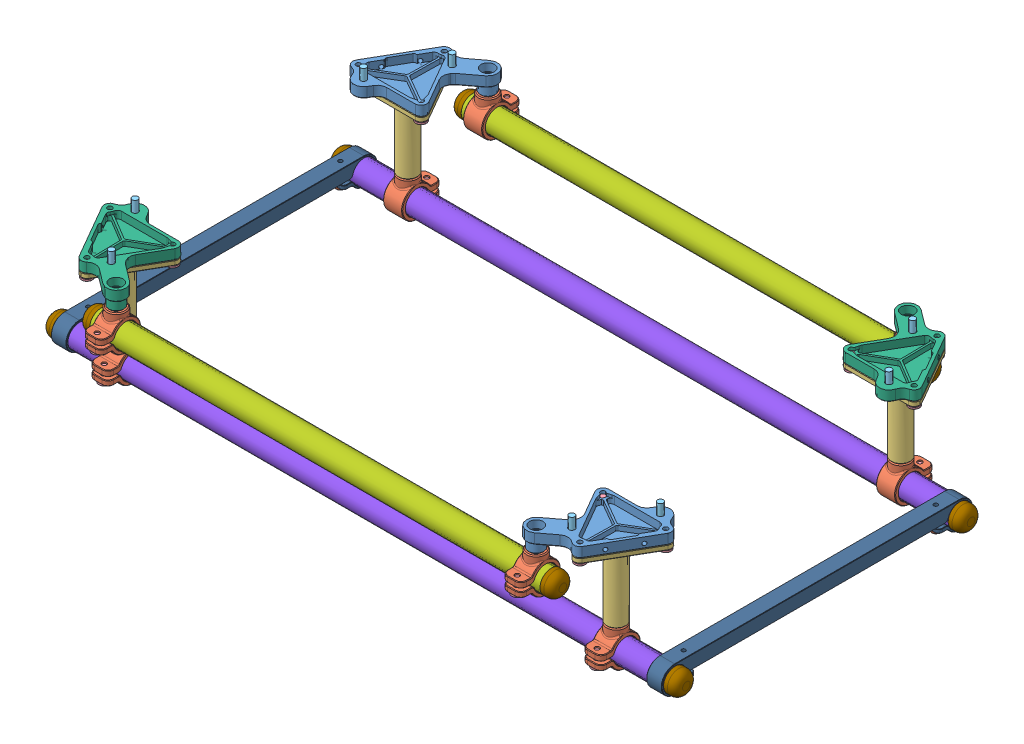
SolidWorks assembly M600 MODULE MOUNT.sldasm, configuration Default (file format 9000). Lengths in mm.
Overall size (335.36 70.79 251.66).
74 component instances, 11 part files, 0 mates.
Components (placement in the parent):
- M600 MODULE MOUNT_2-001-1: M600 MODULE MOUNT_2-001.sldasm [Default] at (168.1458 -5.6 97.079) x (0.5 0 -0.866025) z (0.866025 0 0.5) size (71.88 70.3 50.95)
  - M600 MODULE MOUNT_2-01-1: M600 MODULE MOUNT_2-01.sldprt [Default] x (1 0 0) z (0 -1 0) size (56.3 34.5 12.5)
  - M600 MODULE MOUNT_2-02-1: M600 MODULE MOUNT_2-02.sldprt [Default] at (0 -52.5 -45) x (0.866025 0 -0.5) z (0.5 0 0.866025) size (21 19 10.17)
  - M600 MODULE MOUNT_2-03-1: M600 MODULE MOUNT_2-03.sldprt [Default] at (0 -41.5 -45) x (-0.5 0 0.866025) z (-0.866025 0 -0.5) size (38.91 42 34.5)
  - M600 MODULE MOUNT_2-02-2: M600 MODULE MOUNT_2-02.sldprt [Default] at (-29.3 -17.5 -50.1962) x (0.866025 0 -0.5) z (0.5 0 0.866025) size (21 19 10.17)
  - D600 BASE_3-12-1: D600 BASE_3-12.sldprt [Default] at (-16.4545 -5 -35.5) x (0.999947 0 0.010342) z (0 1 0) size (5.5 5.5 7.5)
  - D600 BASE_3-12-2: D600 BASE_3-12.sldprt [Default] at (16.4545 -5 -35.5) x (0.999947 0 0.010342) z (0 1 0) size (5.5 5.5 7.5)
  - D600 BASE_3-12-3: D600 BASE_3-12.sldprt [Default] at (0 -5 -64) x (0.999947 0 0.010342) z (0 1 0) size (5.5 5.5 7.5)
  - D600 BASE_3-12-4: D600 BASE_3-12.sldprt [Default] at (-37.9603 -22 -45.1962) x (0.999947 0 0.010342) z (0 1 0) size (5.5 5.5 7.5)
  - D600 BASE_3-12-5: D600 BASE_3-12.sldprt [Default] at (-29.3 -11 -50.1962) x (0.999947 0 0.010342) z (0 1 0) size (5.5 5.5 7.5)
  - D600 BASE_3-12-6: D600 BASE_3-12.sldprt [Default] at (-8.6603 -57 -40) x (0.999947 0 0.010342) z (0 1 0) size (5.5 5.5 7.5)
  - D600 BASE_3-12-7: D600 BASE_3-12.sldprt [Default] at (0 -46 -45) x (0.999947 0 0.010342) z (0 1 0) size (5.5 5.5 7.5)
  - D600 BASE_6-08-1: D600 BASE_6-08.sldprt [Default] at (-17 1 -45) x (0.957409 0 0.288735) z (0 1 0) size (5.5 5.5 8.8)
  - D600 BASE_6-08-2: D600 BASE_6-08.sldprt [Default] at (17 1 -45) x (0.957409 0 0.288735) z (0 1 0) size (5.5 5.5 8.8)
- M600 MODULE MOUNT_2-001-2: M600 MODULE MOUNT_2-001.sldasm [Default] at (-168.1458 -5.6 -97.079) x (-0.5 0 0.866025) z (-0.866025 0 -0.5) size (71.88 70.3 50.95)
  - M600 MODULE MOUNT_2-01-1: M600 MODULE MOUNT_2-01.sldprt [Default] x (1 0 0) z (0 -1 0) size (56.3 34.5 12.5)
  - M600 MODULE MOUNT_2-02-1: M600 MODULE MOUNT_2-02.sldprt [Default] at (0 -52.5 -45) x (0.866025 0 -0.5) z (0.5 0 0.866025) size (21 19 10.17)
  - M600 MODULE MOUNT_2-03-1: M600 MODULE MOUNT_2-03.sldprt [Default] at (0 -41.5 -45) x (-0.5 0 0.866025) z (-0.866025 0 -0.5) size (38.91 42 34.5)
  - M600 MODULE MOUNT_2-02-2: M600 MODULE MOUNT_2-02.sldprt [Default] at (-29.3 -17.5 -50.1962) x (0.866025 0 -0.5) z (0.5 0 0.866025) size (21 19 10.17)
  - D600 BASE_3-12-1: D600 BASE_3-12.sldprt [Default] at (-16.4545 -5 -35.5) x (0.999947 0 0.010342) z (0 1 0) size (5.5 5.5 7.5)
  - D600 BASE_3-12-2: D600 BASE_3-12.sldprt [Default] at (16.4545 -5 -35.5) x (0.999947 0 0.010342) z (0 1 0) size (5.5 5.5 7.5)
  - D600 BASE_3-12-3: D600 BASE_3-12.sldprt [Default] at (0 -5 -64) x (0.999947 0 0.010342) z (0 1 0) size (5.5 5.5 7.5)
  - D600 BASE_3-12-4: D600 BASE_3-12.sldprt [Default] at (-37.9603 -22 -45.1962) x (0.999947 0 0.010342) z (0 1 0) size (5.5 5.5 7.5)
  - D600 BASE_3-12-5: D600 BASE_3-12.sldprt [Default] at (-29.3 -11 -50.1962) x (0.999947 0 0.010342) z (0 1 0) size (5.5 5.5 7.5)
  - D600 BASE_3-12-6: D600 BASE_3-12.sldprt [Default] at (-8.6603 -57 -40) x (0.999947 0 0.010342) z (0 1 0) size (5.5 5.5 7.5)
  - D600 BASE_3-12-7: D600 BASE_3-12.sldprt [Default] at (0 -46 -45) x (0.999947 0 0.010342) z (0 1 0) size (5.5 5.5 7.5)
  - D600 BASE_6-08-1: D600 BASE_6-08.sldprt [Default] at (-17 1 -45) x (0.957409 0 0.288735) z (0 1 0) size (5.5 5.5 8.8)
  - D600 BASE_6-08-2: D600 BASE_6-08.sldprt [Default] at (17 1 -45) x (0.957409 0 0.288735) z (0 1 0) size (5.5 5.5 8.8)
- M600 MODULE MOUNT_2-002-1: M600 MODULE MOUNT_2-002.sldasm [Default] at (-129.1747 -5.6 74.579) x (-0.5 0 -0.866025) z (0.866025 0 -0.5) size (65.1 70.3 36.26)
  - M600 MODULE MOUNT_2-03-1: M600 MODULE MOUNT_2-03.sldprt [Default] at (0 -41.5 0) x (-1 0 0) z (0 0 -1) size (38.91 42 34.5)
  - M600 MODULE MOUNT_2-02-1: M600 MODULE MOUNT_2-02.sldprt [Default] at (0 -52.5 0) x (0.866025 0 0.5) z (-0.5 0 0.866025) size (21 19 10.17)
  - M600 MODULE MOUNT_2-04-1: M600 MODULE MOUNT_2-04.sldprt [Default] x (1 0 0) z (0 -1 0) size (56.3 34.5 12.5)
  - M600 MODULE MOUNT_2-02-2: M600 MODULE MOUNT_2-02.sldprt [Default] at (-29.3 -17.5 5.1962) x (0.866025 0 0.5) z (-0.5 0 0.866025) size (21 19 10.17)
  - D600 BASE_3-12-1: D600 BASE_3-12.sldprt [Default] at (0 -5 19) x (0.752686 0 0.65838) z (0 1 0) size (5.5 5.5 7.5)
  - D600 BASE_3-12-2: D600 BASE_3-12.sldprt [Default] at (-16.4545 -5 -9.5) x (0.752686 0 0.65838) z (0 1 0) size (5.5 5.5 7.5)
  - D600 BASE_3-12-3: D600 BASE_3-12.sldprt [Default] at (16.4545 -5 -9.5) x (0.752686 0 0.65838) z (0 1 0) size (5.5 5.5 7.5)
  - D600 BASE_3-12-4: D600 BASE_3-12.sldprt [Default] at (-29.3 -11 5.1962) x (0.999882 0 0.015357) z (0 1 0) size (5.5 5.5 7.5)
  - D600 BASE_3-12-5: D600 BASE_3-12.sldprt [Default] at (-37.9603 -22 0.1962) x (-0.837957 0 -0.545736) z (0 1 0) size (5.5 5.5 7.5)
  - D600 BASE_3-12-6: D600 BASE_3-12.sldprt [Default] at (-8.6603 -57 -5) x (0.752686 0 0.65838) z (0 1 0) size (5.5 5.5 7.5)
  - D600 BASE_3-12-7: D600 BASE_3-12.sldprt [Default] at (0 -46 0) x (0.752686 0 0.65838) z (0 1 0) size (5.5 5.5 7.5)
  - D600 BASE_6-08-1: D600 BASE_6-08.sldprt [Default] at (17 1 0) x (0.889089 0 -0.457734) z (0 1 0) size (5.5 5.5 8.8)
  - D600 BASE_6-08-2: D600 BASE_6-08.sldprt [Default] at (-17 1 0) x (0.503799 0 -0.863821) z (0 1 0) size (5.5 5.5 8.8)
- M600 MODULE MOUNT_2-002-2: M600 MODULE MOUNT_2-002.sldasm [Default] at (129.1747 -5.6 -74.579) x (0.5 0 0.866025) z (-0.866025 0 0.5) size (65.1 70.3 36.26)
  - M600 MODULE MOUNT_2-03-1: M600 MODULE MOUNT_2-03.sldprt [Default] at (0 -41.5 0) x (-1 0 0) z (0 0 -1) size (38.91 42 34.5)
  - M600 MODULE MOUNT_2-02-1: M600 MODULE MOUNT_2-02.sldprt [Default] at (0 -52.5 0) x (0.866025 0 0.5) z (-0.5 0 0.866025) size (21 19 10.17)
  - M600 MODULE MOUNT_2-04-1: M600 MODULE MOUNT_2-04.sldprt [Default] x (1 0 0) z (0 -1 0) size (56.3 34.5 12.5)
  - M600 MODULE MOUNT_2-02-2: M600 MODULE MOUNT_2-02.sldprt [Default] at (-29.3 -17.5 5.1962) x (0.866025 0 0.5) z (-0.5 0 0.866025) size (21 19 10.17)
  - D600 BASE_3-12-1: D600 BASE_3-12.sldprt [Default] at (0 -5 19) x (0.752686 0 0.65838) z (0 1 0) size (5.5 5.5 7.5)
  - D600 BASE_3-12-2: D600 BASE_3-12.sldprt [Default] at (-16.4545 -5 -9.5) x (0.752686 0 0.65838) z (0 1 0) size (5.5 5.5 7.5)
  - D600 BASE_3-12-3: D600 BASE_3-12.sldprt [Default] at (16.4545 -5 -9.5) x (0.752686 0 0.65838) z (0 1 0) size (5.5 5.5 7.5)
  - D600 BASE_3-12-4: D600 BASE_3-12.sldprt [Default] at (-29.3 -11 5.1962) x (0.999882 0 0.015357) z (0 1 0) size (5.5 5.5 7.5)
  - D600 BASE_3-12-5: D600 BASE_3-12.sldprt [Default] at (-37.9603 -22 0.1962) x (-0.837957 0 -0.545736) z (0 1 0) size (5.5 5.5 7.5)
  - D600 BASE_3-12-6: D600 BASE_3-12.sldprt [Default] at (-8.6603 -57 -5) x (0.752686 0 0.65838) z (0 1 0) size (5.5 5.5 7.5)
  - D600 BASE_3-12-7: D600 BASE_3-12.sldprt [Default] at (0 -46 0) x (0.752686 0 0.65838) z (0 1 0) size (5.5 5.5 7.5)
  - D600 BASE_6-08-1: D600 BASE_6-08.sldprt [Default] at (17 1 0) x (0.889089 0 -0.457734) z (0 1 0) size (5.5 5.5 8.8)
  - D600 BASE_6-08-2: D600 BASE_6-08.sldprt [Default] at (-17 1 0) x (0.503799 0 -0.863821) z (0 1 0) size (5.5 5.5 8.8)
- M600 MODULE MOUNT_2-05-1: M600 MODULE MOUNT_2-05.sldprt [Default] at (-118 -23.1 -97.3555) x (0 -0.259561 -0.965727) z (1 0 0) size (12 12 236)
- M600 MODULE MOUNT_2-06-1: M600 MODULE MOUNT_2-06.sldprt [Default] at (-160 -58.1 -74.579) x (0 0.155529 -0.987831) z (1 0 0) size (12 12 320)
- M600 MODULE MOUNT_2-05-2: M600 MODULE MOUNT_2-05.sldprt [Default] at (-118 -23.1 97.3555) x (0 -0.259561 -0.965727) z (1 0 0) size (12 12 236)
- M600 MODULE MOUNT_2-06-2: M600 MODULE MOUNT_2-06.sldprt [Default] at (-160 -58.1 74.579) x (0 0.037814 -0.999285) z (1 0 0) size (12 12 320)
- M600 MODULE MOUNT_2-07-1: M600 MODULE MOUNT_2-07.sldprt [Default] at (-160 -104.9551 -12.6681) x (0 0.601138 -0.799145) z (0 -0.799145 -0.601138) size (12 15.07 12)
- M600 MODULE MOUNT_2-07-2: M600 MODULE MOUNT_2-07.sldprt [Default] at (-160 -104.9551 136.4899) x (0 0.601138 -0.799145) z (0 -0.799145 -0.601138) size (12 15.07 12)
- M600 MODULE MOUNT_2-07-3: M600 MODULE MOUNT_2-07.sldprt [Default] at (-118 -69.9551 159.2664) x (0 0.601138 -0.799145) z (0 -0.799145 -0.601138) size (12 15.07 12)
- M600 MODULE MOUNT_2-07-4: M600 MODULE MOUNT_2-07.sldprt [Default] at (-118 -69.9551 -35.4446) x (0 0.601138 -0.799145) z (0 -0.799145 -0.601138) size (12 15.07 12)
- M600 MODULE MOUNT_2-07-5: M600 MODULE MOUNT_2-07.sldprt [Default] at (118 -77.6229 42.0779) x (0 0.700145 0.714001) z (0 -0.714001 0.700145) size (12 15.07 12)
- M600 MODULE MOUNT_2-07-6: M600 MODULE MOUNT_2-07.sldprt [Default] at (160 -112.6229 19.3014) x (0 0.700145 0.714001) z (0 -0.714001 0.700145) size (12 15.07 12)
- M600 MODULE MOUNT_2-07-7: M600 MODULE MOUNT_2-07.sldprt [Default] at (160 -114.8323 -127.5866) x (0 0.728687 0.684847) z (0 -0.684847 0.728687) size (12 15.07 12)
- M600 MODULE MOUNT_2-07-8: M600 MODULE MOUNT_2-07.sldprt [Default] at (118 -79.8323 -150.3631) x (0 0.728687 0.684847) z (0 -0.684847 0.728687) size (12 15.07 12)
- M600 MODULE MOUNT_2-08-1: M600 MODULE MOUNT_2-08.sldprt [Default] at (152 -58.1 -0.001) x (0 0 -1) z (1 0 0) size (163.16 14 8)
- M600 MODULE MOUNT_2-08-2: M600 MODULE MOUNT_2-08.sldprt [Default] at (-160 -58.1 0.001) x (0 0 -1) z (1 0 0) size (163.16 14 8)
- M600 MODULE MOUNT_4-07-1: M600 MODULE MOUNT_4-07.sldprt [Default] at (-156 -55.4 -66.079) x (0.233095 0 -0.972454) z (0 -1 0) size (4.45 4.45 7.4)
- M600 MODULE MOUNT_4-07-2: M600 MODULE MOUNT_4-07.sldprt [Default] at (-156 -55.4 66.081) x (0.233095 0 -0.972454) z (0 -1 0) size (4.45 4.45 7.4)
- M600 MODULE MOUNT_4-07-3: M600 MODULE MOUNT_4-07.sldprt [Default] at (156 -55.4 66.079) x (0.233095 0 -0.972454) z (0 -1 0) size (4.45 4.45 7.4)
- M600 MODULE MOUNT_4-07-4: M600 MODULE MOUNT_4-07.sldprt [Default] at (156 -55.4 -66.081) x (0.233095 0 -0.972454) z (0 -1 0) size (4.45 4.45 7.4)
